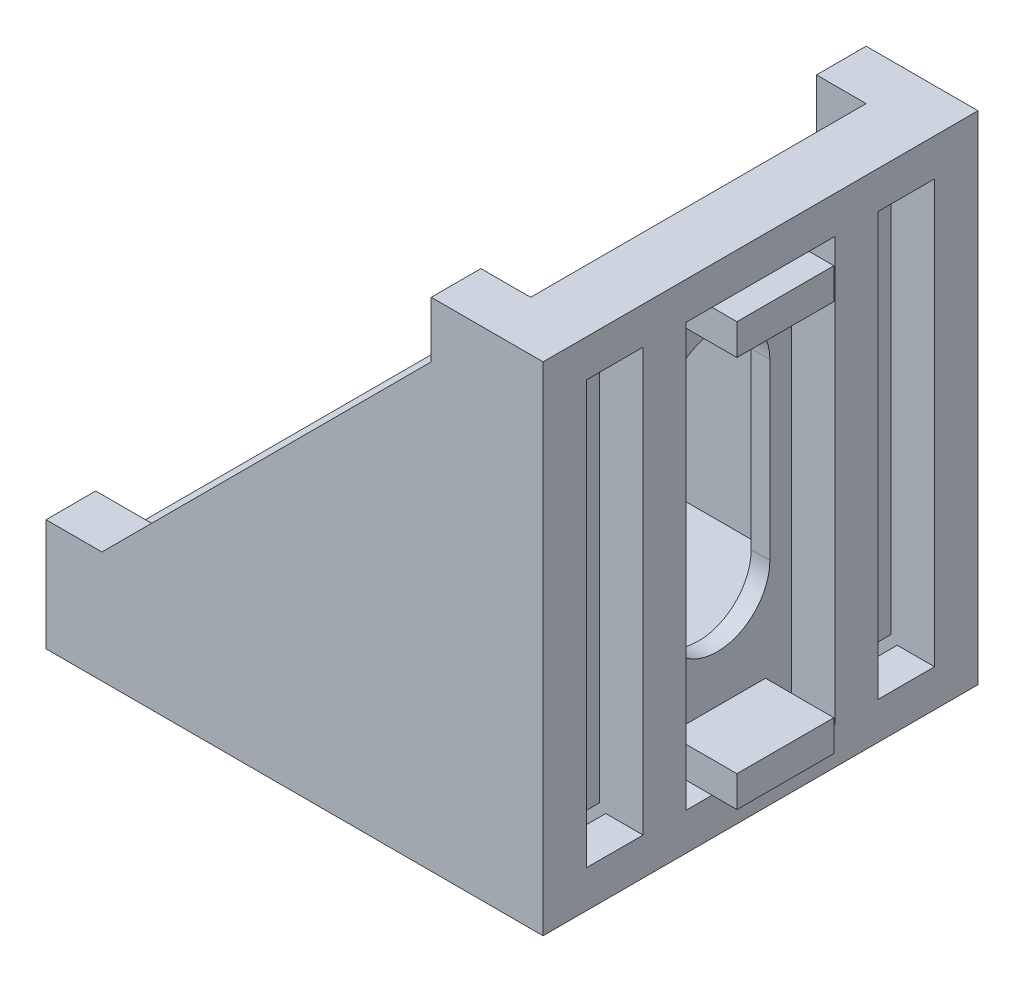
from build123d import *

# Parameters (mm, degrees)
SKETCH_1_W          = 40
SKETCH_1_H          = 40
EXTRUDE_1_DEPTH     = 17.5
CUT_EXTRUDE_1_DEPTH = 46
SKETCH_3_W          = 35
SKETCH_3_H          = 27
CUT_EXTRUDE_2_DEPTH = 35
SKETCH_4_W          = 4.547616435
SKETCH_4_H          = 34
SKETCH_4_W_2        = 12
CUT_EXTRUDE_3_DEPTH = 3.5
CUT_EXTRUDE_4_DEPTH = 3.5
SKETCH_6_W          = 7.8
SKETCH_6_H          = 2.5
EXTRUDE_2_DEPTH     = 5.5


with BuildPart() as part:
    # Sketch 1 → Extrude 1 (new, symmetric)
    with BuildSketch(Plane.XY):
        Rectangle(SKETCH_1_W, SKETCH_1_H)
    extrude(amount=EXTRUDE_1_DEPTH, both=True)

    # Sketch 2 → Cut-Extrude 1 (cut, through all)
    with BuildSketch(Plane.XY.offset(17.5)):
        Polygon((11, 20), (11, 15.5), (-15.5, -11), (-20, -11), (-20, 20), align=None)
    extrude(amount=-CUT_EXTRUDE_1_DEPTH, mode=Mode.SUBTRACT)

    # Sketch 3 → Cut-Extrude 2 (cut)
    with BuildSketch(Plane(origin=(0, 20, 0), x_dir=(1, 0, 0), z_dir=(0, 1, 0))):
        with Locations((-2.5, 0)):
            Rectangle(SKETCH_3_W, SKETCH_3_H)
    extrude(amount=-CUT_EXTRUDE_2_DEPTH, mode=Mode.SUBTRACT)

    # Sketch 4 → Cut-Extrude 3 (cut)
    with BuildSketch(Plane(origin=(20, 0, 0), x_dir=(0, 0, -1), z_dir=(1, 0, 0))):
        with Locations((-11.726191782, 0)):
            Rectangle(SKETCH_4_W, SKETCH_4_H)
        with Locations((11.726191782, 0)):
            Rectangle(SKETCH_4_W, SKETCH_4_H)
        Rectangle(SKETCH_4_W_2, SKETCH_4_H)
    cut_extrude_3 = extrude(amount=-CUT_EXTRUDE_3_DEPTH, mode=Mode.SUBTRACT)

    # Sketch 5 → Cut-Extrude 4 (cut)
    with BuildSketch(Plane(origin=(16.5, 0, 0), x_dir=(0, 0, -1), z_dir=(1, 0, 0))):
        with BuildLine():
            Line((4.25, 7.539737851), (4.25, -6.460262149))
            ThreePointArc((4.25, -6.460262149), (0, -10.710262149), (-4.25, -6.460262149))
            Line((-4.25, -6.460262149), (-4.25, 7.539737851))
            ThreePointArc((-4.25, 7.539737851), (0, 11.789737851), (4.25, 7.539737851))
        make_face()
    cut_extrude_4 = extrude(amount=-CUT_EXTRUDE_4_DEPTH, mode=Mode.SUBTRACT)

    # Sketch 6 → Extrude 2 (add)
    with BuildSketch(Plane(origin=(16.5, 0, 0), x_dir=(0, 0, -1), z_dir=(1, 0, 0))):
        with Locations((0, 15.75)):
            Rectangle(SKETCH_6_W, SKETCH_6_H)
        with Locations((0, -15.75)):
            Rectangle(SKETCH_6_W, SKETCH_6_H)
    extrude_2 = extrude(amount=EXTRUDE_2_DEPTH)

    # Mirror 1: Cut-Extrude 3, Cut-Extrude 4, Extrude 2 across plane
    add(cut_extrude_3.mirror(Plane(origin=(0, 0, 0), x_dir=(0, 0, 1), z_dir=(0.7071067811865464, 0.7071067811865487, 0))), mode=Mode.SUBTRACT)
    add(cut_extrude_4.mirror(Plane(origin=(0, 0, 0), x_dir=(0, 0, 1), z_dir=(0.7071067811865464, 0.7071067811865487, 0))), mode=Mode.SUBTRACT)
    add(extrude_2.mirror(Plane(origin=(0, 0, 0), x_dir=(0, 0, 1), z_dir=(0.7071067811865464, 0.7071067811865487, 0))))


solid = part.part
